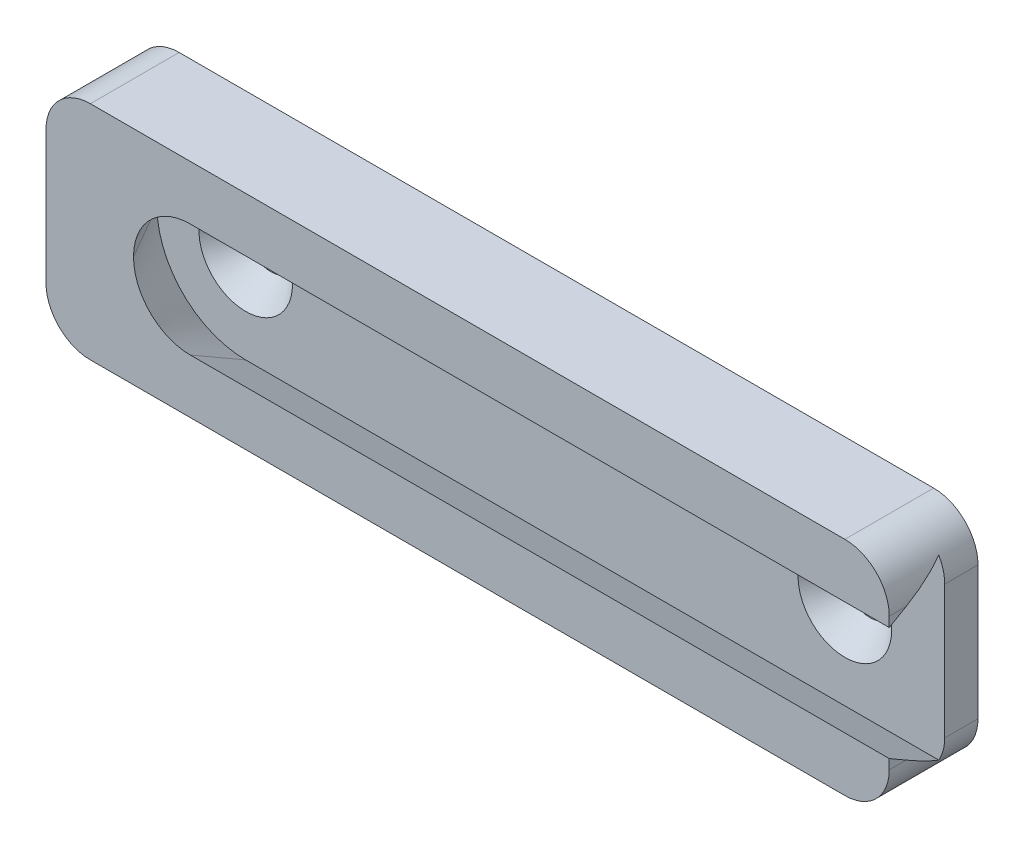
ISO-10303-21;
HEADER;
FILE_DESCRIPTION(('STEP AP214'),'2;1');
FILE_NAME('part.step','',(''),(''),'','','');
FILE_SCHEMA(('AUTOMOTIVE_DESIGN { 1 0 10303 214 1 1 1 1 }'));
ENDSEC;
DATA;
#1=APPLICATION_CONTEXT('core data for automotive mechanical design processes');
#2=APPLICATION_PROTOCOL_DEFINITION('international standard','automotive_design',2000,#1);
#3=PRODUCT_CONTEXT('',#1,'mechanical');
#4=PRODUCT('Part','Part','',(#3));
#5=PRODUCT_RELATED_PRODUCT_CATEGORY('part','',(#4));
#6=PRODUCT_DEFINITION_FORMATION('','',#4);
#7=PRODUCT_DEFINITION_CONTEXT('part definition',#1,'design');
#8=PRODUCT_DEFINITION('design','',#6,#7);
#9=PRODUCT_DEFINITION_SHAPE('','',#8);
#10=(LENGTH_UNIT() NAMED_UNIT(*) SI_UNIT(.MILLI.,.METRE.));
#11=(NAMED_UNIT(*) PLANE_ANGLE_UNIT() SI_UNIT($,.RADIAN.));
#12=(NAMED_UNIT(*) SI_UNIT($,.STERADIAN.) SOLID_ANGLE_UNIT());
#13=UNCERTAINTY_MEASURE_WITH_UNIT(LENGTH_MEASURE(1.E-05),#10,'distance_accuracy_value','');
#14=(GEOMETRIC_REPRESENTATION_CONTEXT(3) GLOBAL_UNCERTAINTY_ASSIGNED_CONTEXT((#13)) GLOBAL_UNIT_ASSIGNED_CONTEXT((#10,
#11,#12)) REPRESENTATION_CONTEXT('',''));
#15=CARTESIAN_POINT('',(0.,0.,0.));
#16=DIRECTION('',(0.,0.,1.));
#17=DIRECTION('',(1.,0.,0.));
#18=AXIS2_PLACEMENT_3D('',#15,#16,#17);
#19=CARTESIAN_POINT('',(-1.11022302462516E-13,9.99999999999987,4.99999999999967));
#20=DIRECTION('',(-1.,0.,0.));
#21=DIRECTION('',(0.,-1.,0.));
#22=AXIS2_PLACEMENT_3D('',#19,#20,#21);
#23=PLANE('',#22);
#24=DIRECTION('',(0.,1.,0.));
#25=VECTOR('',#24,1.);
#26=CARTESIAN_POINT('',(-1.11022302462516E-13,9.99999999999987,4.99999999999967));
#27=LINE('',#26,#25);
#28=CARTESIAN_POINT('',(0.,-6.00000000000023,4.99999999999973));
#29=VERTEX_POINT('',#28);
#30=CARTESIAN_POINT('',(0.,-5.11324865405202,4.99999999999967));
#31=VERTEX_POINT('',#30);
#32=EDGE_CURVE('E203',#29,#31,#27,.T.);
#33=ORIENTED_EDGE('',*,*,#32,.F.);
#34=DIRECTION('',(0.,0.,-1.00000000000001));
#35=VECTOR('',#34,1.);
#36=CARTESIAN_POINT('',(0.,-6.00000000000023,4.99999999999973));
#37=LINE('',#36,#35);
#38=CARTESIAN_POINT('',(0.,-6.00000000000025,3.46410161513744));
#39=VERTEX_POINT('',#38);
#40=EDGE_CURVE('E355',#29,#39,#37,.T.);
#41=ORIENTED_EDGE('',*,*,#40,.T.);
#42=DIRECTION('',(0.,-0.499999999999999,-0.866025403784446));
#43=VECTOR('',#42,1.);
#44=CARTESIAN_POINT('',(0.,-3.00000000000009,8.66025403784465));
#45=LINE('',#44,#43);
#46=EDGE_CURVE('E183',#39,#31,#45,.F.);
#47=ORIENTED_EDGE('',*,*,#46,.T.);
#48=EDGE_LOOP('',(#33,#41,#47));
#49=FACE_BOUND('',#48,.T.);
#50=ADVANCED_FACE('F37',(#49),#23,.F.);
#51=DIRECTION('',(0.,1.,0.));
#52=VECTOR('',#51,1.);
#53=CARTESIAN_POINT('',(0.,-10.0000000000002,-4.9960036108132E-13));
#54=LINE('',#53,#52);
#55=CARTESIAN_POINT('',(1.11022302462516E-13,-6.00000000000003,-3.88578058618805E-13));
#56=VERTEX_POINT('',#55);
#57=CARTESIAN_POINT('',(0.,5.99999999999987,-4.44089209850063E-13));
#58=VERTEX_POINT('',#57);
#59=EDGE_CURVE('E186',#56,#58,#54,.T.);
#60=ORIENTED_EDGE('',*,*,#59,.F.);
#61=DIRECTION('',(0.,0.,-1.00000000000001));
#62=VECTOR('',#61,1.);
#63=CARTESIAN_POINT('',(0.,-6.00000000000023,4.99999999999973));
#64=LINE('',#63,#62);
#65=CARTESIAN_POINT('',(0.,-6.00000000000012,-3.00000000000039));
#66=VERTEX_POINT('',#65);
#67=EDGE_CURVE('E358',#56,#66,#64,.T.);
#68=ORIENTED_EDGE('',*,*,#67,.T.);
#69=DIRECTION('',(0.,1.,0.));
#70=VECTOR('',#69,1.);
#71=CARTESIAN_POINT('',(1.52655665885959E-13,-10.0000000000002,-3.00000000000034));
#72=LINE('',#71,#70);
#73=CARTESIAN_POINT('',(-1.11022302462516E-13,5.99999999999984,-3.00000000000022));
#74=VERTEX_POINT('',#73);
#75=EDGE_CURVE('E190',#66,#74,#72,.T.);
#76=ORIENTED_EDGE('',*,*,#75,.T.);
#77=DIRECTION('',(0.,0.,-1.00000000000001));
#78=VECTOR('',#77,1.);
#79=CARTESIAN_POINT('',(-1.66533453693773E-13,5.99999999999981,4.99999999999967));
#80=LINE('',#79,#78);
#81=EDGE_CURVE('E321',#74,#58,#80,.F.);
#82=ORIENTED_EDGE('',*,*,#81,.T.);
#83=EDGE_LOOP('',(#60,#68,#76,#82));
#84=FACE_BOUND('',#83,.T.);
#85=ADVANCED_FACE('F298',(#84),#23,.F.);
#86=CARTESIAN_POINT('',(-76.0000000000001,9.9999999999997,4.99999999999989));
#87=DIRECTION('',(1.,0.,0.));
#88=DIRECTION('',(0.,0.,-1.00000000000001));
#89=AXIS2_PLACEMENT_3D('',#86,#87,#88);
#90=PLANE('',#89);
#91=DIRECTION('',(0.,-1.,0.));
#92=VECTOR('',#91,1.);
#93=CARTESIAN_POINT('',(-76.,-10.0000000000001,-3.00000000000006));
#94=LINE('',#93,#92);
#95=CARTESIAN_POINT('',(-76.,5.99999999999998,-2.99999999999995));
#96=VERTEX_POINT('',#95);
#97=CARTESIAN_POINT('',(-76.,-6.00000000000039,-2.99999999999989));
#98=VERTEX_POINT('',#97);
#99=EDGE_CURVE('E240',#96,#98,#94,.T.);
#100=ORIENTED_EDGE('',*,*,#99,.T.);
#101=DIRECTION('',(0.,0.,-1.00000000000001));
#102=VECTOR('',#101,1.);
#103=CARTESIAN_POINT('',(-76.0000000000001,-6.00000000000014,5.));
#104=LINE('',#103,#102);
#105=CARTESIAN_POINT('',(-76.0000000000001,-6.00000000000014,5.));
#106=VERTEX_POINT('',#105);
#107=EDGE_CURVE('E11',#98,#106,#104,.F.);
#108=ORIENTED_EDGE('',*,*,#107,.T.);
#109=DIRECTION('',(0.,-1.,0.));
#110=VECTOR('',#109,1.);
#111=CARTESIAN_POINT('',(-76.0000000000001,9.9999999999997,4.99999999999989));
#112=LINE('',#111,#110);
#113=CARTESIAN_POINT('',(-76.0000000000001,5.99999999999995,5.00000000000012));
#114=VERTEX_POINT('',#113);
#115=EDGE_CURVE('E198',#114,#106,#112,.T.);
#116=ORIENTED_EDGE('',*,*,#115,.F.);
#117=DIRECTION('',(0.,0.,-1.00000000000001));
#118=VECTOR('',#117,1.);
#119=CARTESIAN_POINT('',(-76.0000000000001,5.99999999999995,5.00000000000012));
#120=LINE('',#119,#118);
#121=EDGE_CURVE('E45',#114,#96,#120,.T.);
#122=ORIENTED_EDGE('',*,*,#121,.T.);
#123=EDGE_LOOP('',(#100,#108,#116,#122));
#124=FACE_BOUND('',#123,.T.);
#125=ADVANCED_FACE('F239',(#124),#90,.F.);
#126=CARTESIAN_POINT('',(-76.0000000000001,-10.0000000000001,5.));
#127=DIRECTION('',(0.,1.,0.));
#128=DIRECTION('',(-1.,0.,0.));
#129=AXIS2_PLACEMENT_3D('',#126,#127,#128);
#130=PLANE('',#129);
#131=DIRECTION('',(1.,0.,0.));
#132=VECTOR('',#131,1.);
#133=CARTESIAN_POINT('',(1.52655665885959E-13,-10.0000000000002,-3.00000000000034));
#134=LINE('',#133,#132);
#135=CARTESIAN_POINT('',(-72.,-10.0000000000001,-2.99999999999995));
#136=VERTEX_POINT('',#135);
#137=CARTESIAN_POINT('',(-3.99999999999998,-10.0000000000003,-3.00000000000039));
#138=VERTEX_POINT('',#137);
#139=EDGE_CURVE('E196',#136,#138,#134,.T.);
#140=ORIENTED_EDGE('',*,*,#139,.T.);
#141=DIRECTION('',(0.,0.,-1.00000000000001));
#142=VECTOR('',#141,1.);
#143=CARTESIAN_POINT('',(-3.99999999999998,-10.0000000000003,4.99999999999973));
#144=LINE('',#143,#142);
#145=CARTESIAN_POINT('',(-3.99999999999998,-10.0000000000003,4.99999999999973));
#146=VERTEX_POINT('',#145);
#147=EDGE_CURVE('E345',#138,#146,#144,.F.);
#148=ORIENTED_EDGE('',*,*,#147,.T.);
#149=DIRECTION('',(1.,0.,0.));
#150=VECTOR('',#149,1.);
#151=CARTESIAN_POINT('',(-76.0000000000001,-10.0000000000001,5.));
#152=LINE('',#151,#150);
#153=CARTESIAN_POINT('',(-72.0000000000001,-10.,4.99999999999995));
#154=VERTEX_POINT('',#153);
#155=EDGE_CURVE('E200',#154,#146,#152,.T.);
#156=ORIENTED_EDGE('',*,*,#155,.F.);
#157=DIRECTION('',(0.,0.,-1.00000000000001));
#158=VECTOR('',#157,1.);
#159=CARTESIAN_POINT('',(-72.0000000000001,-10.,4.99999999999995));
#160=LINE('',#159,#158);
#161=EDGE_CURVE('E342',#154,#136,#160,.T.);
#162=ORIENTED_EDGE('',*,*,#161,.T.);
#163=EDGE_LOOP('',(#140,#148,#156,#162));
#164=FACE_BOUND('',#163,.T.);
#165=ADVANCED_FACE('F310',(#164),#130,.F.);
#166=DIRECTION('',(0.,-0.499999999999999,0.866025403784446));
#167=VECTOR('',#166,1.);
#168=CARTESIAN_POINT('',(0.,2.99999999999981,8.66025403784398));
#169=LINE('',#168,#167);
#170=CARTESIAN_POINT('',(-1.38777878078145E-13,5.11324865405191,4.99999999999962));
#171=VERTEX_POINT('',#170);
#172=CARTESIAN_POINT('',(0.,5.99999999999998,3.46410161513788));
#173=VERTEX_POINT('',#172);
#174=EDGE_CURVE('E317',#171,#173,#169,.F.);
#175=ORIENTED_EDGE('',*,*,#174,.T.);
#176=DIRECTION('',(0.,0.,-1.00000000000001));
#177=VECTOR('',#176,1.);
#178=CARTESIAN_POINT('',(-1.66533453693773E-13,5.99999999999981,4.99999999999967));
#179=LINE('',#178,#177);
#180=CARTESIAN_POINT('',(-1.66533453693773E-13,5.99999999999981,4.99999999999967));
#181=VERTEX_POINT('',#180);
#182=EDGE_CURVE('E222',#173,#181,#179,.F.);
#183=ORIENTED_EDGE('',*,*,#182,.T.);
#184=EDGE_CURVE('E202',#171,#181,#27,.T.);
#185=ORIENTED_EDGE('',*,*,#184,.F.);
#186=EDGE_LOOP('',(#175,#183,#185));
#187=FACE_BOUND('',#186,.T.);
#188=ADVANCED_FACE('F301',(#187),#23,.F.);
#189=CARTESIAN_POINT('',(-76.0000000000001,9.9999999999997,4.99999999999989));
#190=DIRECTION('',(0.,-1.,0.));
#191=DIRECTION('',(1.,0.,0.));
#192=AXIS2_PLACEMENT_3D('',#189,#190,#191);
#193=PLANE('',#192);
#194=DIRECTION('',(-1.,0.,0.));
#195=VECTOR('',#194,1.);
#196=CARTESIAN_POINT('',(-76.0000000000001,9.9999999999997,4.99999999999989));
#197=LINE('',#196,#195);
#198=CARTESIAN_POINT('',(-4.00000000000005,9.99999999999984,4.99999999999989));
#199=VERTEX_POINT('',#198);
#200=CARTESIAN_POINT('',(-72.,10.,4.99999999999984));
#201=VERTEX_POINT('',#200);
#202=EDGE_CURVE('E171',#199,#201,#197,.T.);
#203=ORIENTED_EDGE('',*,*,#202,.F.);
#204=DIRECTION('',(0.,0.,-1.00000000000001));
#205=VECTOR('',#204,1.);
#206=CARTESIAN_POINT('',(-4.00000000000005,9.99999999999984,4.99999999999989));
#207=LINE('',#206,#205);
#208=CARTESIAN_POINT('',(-4.00000000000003,9.99999999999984,-3.00000000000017));
#209=VERTEX_POINT('',#208);
#210=EDGE_CURVE('E224',#199,#209,#207,.T.);
#211=ORIENTED_EDGE('',*,*,#210,.T.);
#212=DIRECTION('',(-1.,0.,0.));
#213=VECTOR('',#212,1.);
#214=CARTESIAN_POINT('',(0.,9.9999999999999,-3.00000000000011));
#215=LINE('',#214,#213);
#216=CARTESIAN_POINT('',(-72.0000000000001,9.99999999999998,-3.00000000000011));
#217=VERTEX_POINT('',#216);
#218=EDGE_CURVE('E250',#209,#217,#215,.T.);
#219=ORIENTED_EDGE('',*,*,#218,.T.);
#220=DIRECTION('',(0.,0.,-1.00000000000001));
#221=VECTOR('',#220,1.);
#222=CARTESIAN_POINT('',(-72.,10.,4.99999999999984));
#223=LINE('',#222,#221);
#224=EDGE_CURVE('E228',#217,#201,#223,.F.);
#225=ORIENTED_EDGE('',*,*,#224,.T.);
#226=EDGE_LOOP('',(#203,#211,#219,#225));
#227=FACE_BOUND('',#226,.T.);
#228=ADVANCED_FACE('F309',(#227),#193,.F.);
#229=CARTESIAN_POINT('',(0.,-1.11022302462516E-13,4.99999999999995));
#230=DIRECTION('',(0.,0.,1.00000000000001));
#231=DIRECTION('',(1.,0.,0.));
#232=AXIS2_PLACEMENT_3D('',#229,#230,#231);
#233=PLANE('',#232);
#234=ORIENTED_EDGE('',*,*,#155,.T.);
#235=CARTESIAN_POINT('',(-3.99999999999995,-6.00000000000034,4.99999999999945));
#236=DIRECTION('',(0.,0.,1.00000000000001));
#237=DIRECTION('',(1.,0.,0.));
#238=AXIS2_PLACEMENT_3D('',#235,#236,#237);
#239=CIRCLE('',#238,4.);
#240=EDGE_CURVE('E225',#146,#29,#239,.T.);
#241=ORIENTED_EDGE('',*,*,#240,.T.);
#242=ORIENTED_EDGE('',*,*,#32,.T.);
#243=DIRECTION('',(1.,0.,0.));
#244=VECTOR('',#243,1.);
#245=CARTESIAN_POINT('',(0.,-5.11324865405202,4.99999999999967));
#246=LINE('',#245,#244);
#247=CARTESIAN_POINT('',(-63.0000000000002,-5.11324865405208,4.99999999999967));
#248=VERTEX_POINT('',#247);
#249=EDGE_CURVE('E319',#31,#248,#246,.F.);
#250=ORIENTED_EDGE('',*,*,#249,.T.);
#251=CARTESIAN_POINT('',(-63.0000000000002,-2.77555756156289E-13,4.99999999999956));
#252=DIRECTION('',(0.,0.,1.00000000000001));
#253=DIRECTION('',(1.,0.,0.));
#254=AXIS2_PLACEMENT_3D('',#251,#252,#253);
#255=CIRCLE('',#254,5.11324865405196);
#256=CARTESIAN_POINT('',(-68.1132486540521,-1.66533453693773E-13,4.99999999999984));
#257=VERTEX_POINT('',#256);
#258=EDGE_CURVE('E322',#248,#257,#255,.F.);
#259=ORIENTED_EDGE('',*,*,#258,.T.);
#260=CARTESIAN_POINT('',(-63.0000000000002,-2.77555756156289E-13,4.99999999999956));
#261=DIRECTION('',(0.,0.,1.00000000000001));
#262=DIRECTION('',(1.,0.,0.));
#263=AXIS2_PLACEMENT_3D('',#260,#261,#262);
#264=CIRCLE('',#263,5.11324865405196);
#265=CARTESIAN_POINT('',(-63.0000000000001,5.11324865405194,5.00000000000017));
#266=VERTEX_POINT('',#265);
#267=EDGE_CURVE('E163',#257,#266,#264,.F.);
#268=ORIENTED_EDGE('',*,*,#267,.T.);
#269=DIRECTION('',(-1.,0.,0.));
#270=VECTOR('',#269,1.);
#271=CARTESIAN_POINT('',(-1.38777878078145E-13,5.11324865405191,4.99999999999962));
#272=LINE('',#271,#270);
#273=EDGE_CURVE('E178',#266,#171,#272,.F.);
#274=ORIENTED_EDGE('',*,*,#273,.T.);
#275=ORIENTED_EDGE('',*,*,#184,.T.);
#276=CARTESIAN_POINT('',(-4.00000000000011,5.99999999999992,4.99999999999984));
#277=DIRECTION('',(0.,0.,1.00000000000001));
#278=DIRECTION('',(1.,0.,0.));
#279=AXIS2_PLACEMENT_3D('',#276,#277,#278);
#280=CIRCLE('',#279,4.);
#281=EDGE_CURVE('E210',#181,#199,#280,.T.);
#282=ORIENTED_EDGE('',*,*,#281,.T.);
#283=ORIENTED_EDGE('',*,*,#202,.T.);
#284=CARTESIAN_POINT('',(-72.,5.99999999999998,5.00000000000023));
#285=DIRECTION('',(0.,0.,1.00000000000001));
#286=DIRECTION('',(1.,0.,0.));
#287=AXIS2_PLACEMENT_3D('',#284,#285,#286);
#288=CIRCLE('',#287,4.);
#289=EDGE_CURVE('E57',#201,#114,#288,.T.);
#290=ORIENTED_EDGE('',*,*,#289,.T.);
#291=ORIENTED_EDGE('',*,*,#115,.T.);
#292=CARTESIAN_POINT('',(-72.0000000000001,-6.00000000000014,4.99999999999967));
#293=DIRECTION('',(0.,0.,1.00000000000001));
#294=DIRECTION('',(1.,0.,0.));
#295=AXIS2_PLACEMENT_3D('',#292,#293,#294);
#296=CIRCLE('',#295,4.);
#297=EDGE_CURVE('E226',#106,#154,#296,.T.);
#298=ORIENTED_EDGE('',*,*,#297,.T.);
#299=EDGE_LOOP('',(#234,#241,#242,#250,#259,#268,#274,#275,#282,#283,#290,#291,#298));
#300=FACE_BOUND('',#299,.T.);
#301=ADVANCED_FACE('F209',(#300),#233,.T.);
#302=CARTESIAN_POINT('',(0.,2.99999999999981,8.66025403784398));
#303=DIRECTION('',(0.,0.866025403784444,0.499999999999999));
#304=DIRECTION('',(1.,0.,0.));
#305=AXIS2_PLACEMENT_3D('',#302,#303,#304);
#306=PLANE('',#305);
#307=DIRECTION('',(-1.,0.,0.));
#308=VECTOR('',#307,1.);
#309=CARTESIAN_POINT('',(0.,8.00000000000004,-3.33066907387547E-13));
#310=LINE('',#309,#308);
#311=CARTESIAN_POINT('',(-0.535898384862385,7.99999999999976,-3.33066907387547E-13));
#312=VERTEX_POINT('',#311);
#313=CARTESIAN_POINT('',(-63.0000000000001,7.99999999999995,-1.11022302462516E-13));
#314=VERTEX_POINT('',#313);
#315=EDGE_CURVE('E168',#312,#314,#310,.T.);
#316=ORIENTED_EDGE('',*,*,#315,.F.);
#317=CARTESIAN_POINT('',(-4.00000000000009,5.99999999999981,3.46410161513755));
#318=DIRECTION('',(0.,0.866025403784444,0.499999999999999));
#319=DIRECTION('',(0.,0.499999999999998,-0.866025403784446));
#320=AXIS2_PLACEMENT_3D('',#317,#318,#319);
#321=ELLIPSE('',#320,8.00000000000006,4.);
#322=EDGE_CURVE('E235',#312,#173,#321,.F.);
#323=ORIENTED_EDGE('',*,*,#322,.T.);
#324=ORIENTED_EDGE('',*,*,#174,.F.);
#325=ORIENTED_EDGE('',*,*,#273,.F.);
#326=DIRECTION('',(0.,-0.499999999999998,0.866025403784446));
#327=VECTOR('',#326,1.);
#328=CARTESIAN_POINT('',(-63.0000000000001,7.99999999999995,-1.11022302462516E-13));
#329=LINE('',#328,#327);
#330=EDGE_CURVE('E164',#314,#266,#329,.T.);
#331=ORIENTED_EDGE('',*,*,#330,.F.);
#332=EDGE_LOOP('',(#316,#323,#324,#325,#331));
#333=FACE_BOUND('',#332,.T.);
#334=ADVANCED_FACE('F364',(#333),#306,.F.);
#335=CARTESIAN_POINT('',(-63.0000000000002,-3.33066907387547E-13,-1.66533453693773E-13));
#336=DIRECTION('',(0.,0.,-1.00000000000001));
#337=DIRECTION('',(-1.,0.,0.));
#338=AXIS2_PLACEMENT_3D('',#335,#336,#337);
#339=CONICAL_SURFACE('',#338,8.00000000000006,0.523598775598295);
#340=ORIENTED_EDGE('',*,*,#330,.T.);
#341=ORIENTED_EDGE('',*,*,#267,.F.);
#342=DIRECTION('',(0.499999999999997,0.,0.866025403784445));
#343=VECTOR('',#342,1.);
#344=CARTESIAN_POINT('',(-71.0000000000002,0.,-1.66533453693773E-13));
#345=LINE('',#344,#343);
#346=CARTESIAN_POINT('',(-71.0000000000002,0.,-1.66533453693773E-13));
#347=VERTEX_POINT('',#346);
#348=EDGE_CURVE('E149',#347,#257,#345,.T.);
#349=ORIENTED_EDGE('',*,*,#348,.F.);
#350=CARTESIAN_POINT('',(-63.0000000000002,-3.33066907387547E-13,-1.66533453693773E-13));
#351=DIRECTION('',(0.,0.,1.00000000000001));
#352=DIRECTION('',(1.,0.,0.));
#353=AXIS2_PLACEMENT_3D('',#350,#351,#352);
#354=CIRCLE('',#353,8.00000000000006);
#355=EDGE_CURVE('E156',#314,#347,#354,.T.);
#356=ORIENTED_EDGE('',*,*,#355,.F.);
#357=EDGE_LOOP('',(#340,#341,#349,#356));
#358=FACE_BOUND('',#357,.T.);
#359=ADVANCED_FACE('F162',(#358),#339,.F.);
#360=CARTESIAN_POINT('',(-63.0000000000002,-3.33066907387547E-13,-1.66533453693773E-13));
#361=DIRECTION('',(0.,0.,-1.00000000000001));
#362=DIRECTION('',(-1.,0.,0.));
#363=AXIS2_PLACEMENT_3D('',#360,#361,#362);
#364=CONICAL_SURFACE('',#363,8.00000000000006,0.523598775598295);
#365=ORIENTED_EDGE('',*,*,#348,.T.);
#366=ORIENTED_EDGE('',*,*,#258,.F.);
#367=DIRECTION('',(0.,0.499999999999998,0.866025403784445));
#368=VECTOR('',#367,1.);
#369=CARTESIAN_POINT('',(-63.0000000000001,-8.00000000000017,-3.88578058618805E-13));
#370=LINE('',#369,#368);
#371=CARTESIAN_POINT('',(-63.0000000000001,-8.00000000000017,-3.88578058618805E-13));
#372=VERTEX_POINT('',#371);
#373=EDGE_CURVE('E151',#372,#248,#370,.T.);
#374=ORIENTED_EDGE('',*,*,#373,.F.);
#375=CARTESIAN_POINT('',(-63.0000000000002,-3.33066907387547E-13,-1.66533453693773E-13));
#376=DIRECTION('',(0.,0.,1.00000000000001));
#377=DIRECTION('',(1.,0.,0.));
#378=AXIS2_PLACEMENT_3D('',#375,#376,#377);
#379=CIRCLE('',#378,8.00000000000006);
#380=EDGE_CURVE('E145',#347,#372,#379,.T.);
#381=ORIENTED_EDGE('',*,*,#380,.F.);
#382=EDGE_LOOP('',(#365,#366,#374,#381));
#383=FACE_BOUND('',#382,.T.);
#384=ADVANCED_FACE('F147',(#383),#364,.F.);
#385=CARTESIAN_POINT('',(0.,-3.00000000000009,8.66025403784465));
#386=DIRECTION('',(0.,-0.866025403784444,0.499999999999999));
#387=DIRECTION('',(-1.,0.,0.));
#388=AXIS2_PLACEMENT_3D('',#385,#386,#387);
#389=PLANE('',#388);
#390=ORIENTED_EDGE('',*,*,#46,.F.);
#391=CARTESIAN_POINT('',(-3.99999999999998,-6.00000000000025,3.46410161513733));
#392=DIRECTION('',(0.,-0.866025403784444,0.499999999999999));
#393=DIRECTION('',(0.,-0.499999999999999,-0.866025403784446));
#394=AXIS2_PLACEMENT_3D('',#391,#392,#393);
#395=ELLIPSE('',#394,8.00000000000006,4.);
#396=CARTESIAN_POINT('',(-0.535898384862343,-8.0000000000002,-1.66533453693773E-13));
#397=VERTEX_POINT('',#396);
#398=EDGE_CURVE('E330',#39,#397,#395,.F.);
#399=ORIENTED_EDGE('',*,*,#398,.T.);
#400=DIRECTION('',(1.,0.,0.));
#401=VECTOR('',#400,1.);
#402=CARTESIAN_POINT('',(0.,-8.00000000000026,-3.88578058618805E-13));
#403=LINE('',#402,#401);
#404=EDGE_CURVE('E155',#372,#397,#403,.T.);
#405=ORIENTED_EDGE('',*,*,#404,.F.);
#406=ORIENTED_EDGE('',*,*,#373,.T.);
#407=ORIENTED_EDGE('',*,*,#249,.F.);
#408=EDGE_LOOP('',(#390,#399,#405,#406,#407));
#409=FACE_BOUND('',#408,.T.);
#410=ADVANCED_FACE('F367',(#409),#389,.F.);
#411=CARTESIAN_POINT('',(0.,-1.66533453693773E-13,-3.00000000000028));
#412=DIRECTION('',(0.,0.,1.00000000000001));
#413=DIRECTION('',(1.,0.,0.));
#414=AXIS2_PLACEMENT_3D('',#411,#412,#413);
#415=PLANE('',#414);
#416=CARTESIAN_POINT('',(-63.0000000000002,0.,-3.00000000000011));
#417=DIRECTION('',(0.,0.,1.00000000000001));
#418=DIRECTION('',(1.,0.,0.));
#419=AXIS2_PLACEMENT_3D('',#416,#417,#418);
#420=CIRCLE('',#419,2.2479);
#421=CARTESIAN_POINT('',(-60.7521000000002,0.,-3.00000000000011));
#422=VERTEX_POINT('',#421);
#423=EDGE_CURVE('E264',#422,#422,#420,.T.);
#424=ORIENTED_EDGE('',*,*,#423,.T.);
#425=EDGE_LOOP('',(#424));
#426=FACE_BOUND('',#425,.T.);
#427=CARTESIAN_POINT('',(-9.00000000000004,-1.66533453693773E-13,-3.00000000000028));
#428=DIRECTION('',(0.,0.,1.00000000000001));
#429=DIRECTION('',(1.,0.,0.));
#430=AXIS2_PLACEMENT_3D('',#427,#428,#429);
#431=CIRCLE('',#430,2.2479);
#432=CARTESIAN_POINT('',(-6.75210000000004,-1.66658237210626E-13,-3.00000000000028));
#433=VERTEX_POINT('',#432);
#434=EDGE_CURVE('E191',#433,#433,#431,.T.);
#435=ORIENTED_EDGE('',*,*,#434,.T.);
#436=EDGE_LOOP('',(#435));
#437=FACE_BOUND('',#436,.T.);
#438=ORIENTED_EDGE('',*,*,#75,.F.);
#439=CARTESIAN_POINT('',(-3.99999999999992,-6.00000000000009,-3.00000000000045));
#440=DIRECTION('',(0.,0.,1.00000000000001));
#441=DIRECTION('',(1.,0.,0.));
#442=AXIS2_PLACEMENT_3D('',#439,#440,#441);
#443=CIRCLE('',#442,4.);
#444=EDGE_CURVE('E340',#66,#138,#443,.F.);
#445=ORIENTED_EDGE('',*,*,#444,.T.);
#446=ORIENTED_EDGE('',*,*,#139,.F.);
#447=CARTESIAN_POINT('',(-71.9999999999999,-6.00000000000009,-3.00000000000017));
#448=DIRECTION('',(0.,0.,1.00000000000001));
#449=DIRECTION('',(1.,0.,0.));
#450=AXIS2_PLACEMENT_3D('',#447,#448,#449);
#451=CIRCLE('',#450,4.);
#452=EDGE_CURVE('E249',#136,#98,#451,.F.);
#453=ORIENTED_EDGE('',*,*,#452,.T.);
#454=ORIENTED_EDGE('',*,*,#99,.F.);
#455=CARTESIAN_POINT('',(-72.,5.99999999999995,-3.00000000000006));
#456=DIRECTION('',(0.,0.,1.00000000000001));
#457=DIRECTION('',(1.,0.,0.));
#458=AXIS2_PLACEMENT_3D('',#455,#456,#457);
#459=CIRCLE('',#458,4.);
#460=EDGE_CURVE('E246',#96,#217,#459,.F.);
#461=ORIENTED_EDGE('',*,*,#460,.T.);
#462=ORIENTED_EDGE('',*,*,#218,.F.);
#463=CARTESIAN_POINT('',(-4.00000000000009,5.99999999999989,-3.00000000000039));
#464=DIRECTION('',(0.,0.,1.00000000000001));
#465=DIRECTION('',(1.,0.,0.));
#466=AXIS2_PLACEMENT_3D('',#463,#464,#465);
#467=CIRCLE('',#466,4.);
#468=EDGE_CURVE('E338',#209,#74,#467,.F.);
#469=ORIENTED_EDGE('',*,*,#468,.T.);
#470=EDGE_LOOP('',(#438,#445,#446,#453,#454,#461,#462,#469));
#471=FACE_BOUND('',#470,.T.);
#472=ADVANCED_FACE('F244',(#426,#437,#471),#415,.F.);
#473=CARTESIAN_POINT('',(0.,0.,0.));
#474=DIRECTION('',(0.,0.,1.00000000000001));
#475=DIRECTION('',(1.,0.,0.));
#476=AXIS2_PLACEMENT_3D('',#473,#474,#475);
#477=PLANE('',#476);
#478=CARTESIAN_POINT('',(-63.0000000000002,-3.33066907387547E-13,-1.66533453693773E-13));
#479=DIRECTION('',(0.,0.,1.00000000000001));
#480=DIRECTION('',(1.,0.,0.));
#481=AXIS2_PLACEMENT_3D('',#478,#479,#480);
#482=CIRCLE('',#481,4.2164);
#483=CARTESIAN_POINT('',(-58.7836000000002,-3.33300964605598E-13,-1.68171854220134E-13));
#484=VERTEX_POINT('',#483);
#485=EDGE_CURVE('E270',#484,#484,#482,.T.);
#486=ORIENTED_EDGE('',*,*,#485,.F.);
#487=EDGE_LOOP('',(#486));
#488=FACE_BOUND('',#487,.T.);
#489=CARTESIAN_POINT('',(-8.99999999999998,-2.77555756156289E-13,0.));
#490=DIRECTION('',(0.,0.,1.00000000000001));
#491=DIRECTION('',(1.,0.,0.));
#492=AXIS2_PLACEMENT_3D('',#489,#490,#491);
#493=CIRCLE('',#492,4.2164);
#494=CARTESIAN_POINT('',(-4.78359999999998,-2.77789813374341E-13,0.));
#495=VERTEX_POINT('',#494);
#496=EDGE_CURVE('E261',#495,#495,#493,.T.);
#497=ORIENTED_EDGE('',*,*,#496,.F.);
#498=EDGE_LOOP('',(#497));
#499=FACE_BOUND('',#498,.T.);
#500=ORIENTED_EDGE('',*,*,#404,.T.);
#501=CARTESIAN_POINT('',(-3.99999999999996,-6.0000000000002,-3.33066907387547E-13));
#502=DIRECTION('',(0.,0.,1.00000000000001));
#503=DIRECTION('',(1.,0.,0.));
#504=AXIS2_PLACEMENT_3D('',#501,#502,#503);
#505=CIRCLE('',#504,4.);
#506=EDGE_CURVE('E334',#397,#56,#505,.T.);
#507=ORIENTED_EDGE('',*,*,#506,.T.);
#508=ORIENTED_EDGE('',*,*,#59,.T.);
#509=CARTESIAN_POINT('',(-4.,5.99999999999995,-4.9960036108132E-13));
#510=DIRECTION('',(0.,0.,1.00000000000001));
#511=DIRECTION('',(1.,0.,0.));
#512=AXIS2_PLACEMENT_3D('',#509,#510,#511);
#513=CIRCLE('',#512,4.);
#514=EDGE_CURVE('E332',#58,#312,#513,.T.);
#515=ORIENTED_EDGE('',*,*,#514,.T.);
#516=ORIENTED_EDGE('',*,*,#315,.T.);
#517=ORIENTED_EDGE('',*,*,#355,.T.);
#518=ORIENTED_EDGE('',*,*,#380,.T.);
#519=EDGE_LOOP('',(#500,#507,#508,#515,#516,#517,#518));
#520=FACE_BOUND('',#519,.T.);
#521=ADVANCED_FACE('F166',(#488,#499,#520),#477,.T.);
#522=CARTESIAN_POINT('',(-3.99999999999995,-6.00000000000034,4.99999999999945));
#523=DIRECTION('',(0.,0.,-1.00000000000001));
#524=DIRECTION('',(-1.,0.,0.));
#525=AXIS2_PLACEMENT_3D('',#522,#523,#524);
#526=CYLINDRICAL_SURFACE('',#525,4.);
#527=ORIENTED_EDGE('',*,*,#240,.F.);
#528=ORIENTED_EDGE('',*,*,#147,.F.);
#529=ORIENTED_EDGE('',*,*,#444,.F.);
#530=ORIENTED_EDGE('',*,*,#67,.F.);
#531=ORIENTED_EDGE('',*,*,#506,.F.);
#532=ORIENTED_EDGE('',*,*,#398,.F.);
#533=ORIENTED_EDGE('',*,*,#40,.F.);
#534=EDGE_LOOP('',(#527,#528,#529,#530,#531,#532,#533));
#535=FACE_BOUND('',#534,.T.);
#536=ADVANCED_FACE('F278',(#535),#526,.T.);
#537=CARTESIAN_POINT('',(-4.00000000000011,5.99999999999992,4.99999999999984));
#538=DIRECTION('',(0.,0.,-1.00000000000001));
#539=DIRECTION('',(-1.,0.,0.));
#540=AXIS2_PLACEMENT_3D('',#537,#538,#539);
#541=CYLINDRICAL_SURFACE('',#540,4.);
#542=ORIENTED_EDGE('',*,*,#514,.F.);
#543=ORIENTED_EDGE('',*,*,#81,.F.);
#544=ORIENTED_EDGE('',*,*,#468,.F.);
#545=ORIENTED_EDGE('',*,*,#210,.F.);
#546=ORIENTED_EDGE('',*,*,#281,.F.);
#547=ORIENTED_EDGE('',*,*,#182,.F.);
#548=ORIENTED_EDGE('',*,*,#322,.F.);
#549=EDGE_LOOP('',(#542,#543,#544,#545,#546,#547,#548));
#550=FACE_BOUND('',#549,.T.);
#551=ADVANCED_FACE('F220',(#550),#541,.T.);
#552=CARTESIAN_POINT('',(-72.0000000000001,-6.00000000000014,4.99999999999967));
#553=DIRECTION('',(0.,0.,-1.00000000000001));
#554=DIRECTION('',(-1.,0.,0.));
#555=AXIS2_PLACEMENT_3D('',#552,#553,#554);
#556=CYLINDRICAL_SURFACE('',#555,4.);
#557=ORIENTED_EDGE('',*,*,#297,.F.);
#558=ORIENTED_EDGE('',*,*,#107,.F.);
#559=ORIENTED_EDGE('',*,*,#452,.F.);
#560=ORIENTED_EDGE('',*,*,#161,.F.);
#561=EDGE_LOOP('',(#557,#558,#559,#560));
#562=FACE_BOUND('',#561,.T.);
#563=ADVANCED_FACE('F372',(#562),#556,.T.);
#564=CARTESIAN_POINT('',(-72.,5.99999999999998,5.00000000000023));
#565=DIRECTION('',(0.,0.,-1.00000000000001));
#566=DIRECTION('',(-1.,0.,0.));
#567=AXIS2_PLACEMENT_3D('',#564,#565,#566);
#568=CYLINDRICAL_SURFACE('',#567,4.);
#569=ORIENTED_EDGE('',*,*,#289,.F.);
#570=ORIENTED_EDGE('',*,*,#224,.F.);
#571=ORIENTED_EDGE('',*,*,#460,.F.);
#572=ORIENTED_EDGE('',*,*,#121,.F.);
#573=EDGE_LOOP('',(#569,#570,#571,#572));
#574=FACE_BOUND('',#573,.T.);
#575=ADVANCED_FACE('F39',(#574),#568,.T.);
#576=CARTESIAN_POINT('',(-8.99999999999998,-2.77555756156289E-13,0.));
#577=DIRECTION('',(0.,0.,1.00000000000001));
#578=DIRECTION('',(1.,0.,0.));
#579=AXIS2_PLACEMENT_3D('',#576,#577,#578);
#580=CYLINDRICAL_SURFACE('',#579,2.2479);
#581=ORIENTED_EDGE('',*,*,#434,.F.);
#582=EDGE_LOOP('',(#581));
#583=FACE_BOUND('',#582,.T.);
#584=CARTESIAN_POINT('',(-9.00000000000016,-2.4980018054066E-13,-2.26450020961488));
#585=DIRECTION('',(0.,0.,1.00000000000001));
#586=DIRECTION('',(1.,0.,0.));
#587=AXIS2_PLACEMENT_3D('',#584,#585,#586);
#588=CIRCLE('',#587,2.2479);
#589=CARTESIAN_POINT('',(-6.75210000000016,-2.49924964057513E-13,-2.26450020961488));
#590=VERTEX_POINT('',#589);
#591=EDGE_CURVE('E258',#590,#590,#588,.T.);
#592=ORIENTED_EDGE('',*,*,#591,.T.);
#593=EDGE_LOOP('',(#592));
#594=FACE_BOUND('',#593,.T.);
#595=ADVANCED_FACE('F285',(#583,#594),#580,.F.);
#596=CARTESIAN_POINT('',(-8.99999999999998,-2.77555756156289E-13,0.));
#597=DIRECTION('',(0.,0.,1.00000000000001));
#598=DIRECTION('',(1.,0.,0.));
#599=AXIS2_PLACEMENT_3D('',#596,#597,#598);
#600=CONICAL_SURFACE('',#599,4.2164,0.715584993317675);
#601=ORIENTED_EDGE('',*,*,#591,.F.);
#602=EDGE_LOOP('',(#601));
#603=FACE_BOUND('',#602,.T.);
#604=ORIENTED_EDGE('',*,*,#496,.T.);
#605=EDGE_LOOP('',(#604));
#606=FACE_BOUND('',#605,.T.);
#607=ADVANCED_FACE('F282',(#603,#606),#600,.F.);
#608=CARTESIAN_POINT('',(-63.0000000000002,-3.33066907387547E-13,-1.66533453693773E-13));
#609=DIRECTION('',(0.,0.,1.00000000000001));
#610=DIRECTION('',(1.,0.,0.));
#611=AXIS2_PLACEMENT_3D('',#608,#609,#610);
#612=CYLINDRICAL_SURFACE('',#611,2.2479);
#613=ORIENTED_EDGE('',*,*,#423,.F.);
#614=EDGE_LOOP('',(#613));
#615=FACE_BOUND('',#614,.T.);
#616=CARTESIAN_POINT('',(-63.,0.,-2.26450020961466));
#617=DIRECTION('',(0.,0.,1.00000000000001));
#618=DIRECTION('',(1.,0.,0.));
#619=AXIS2_PLACEMENT_3D('',#616,#617,#618);
#620=CIRCLE('',#619,2.2479);
#621=CARTESIAN_POINT('',(-60.7521,0.,-2.26450020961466));
#622=VERTEX_POINT('',#621);
#623=EDGE_CURVE('E267',#622,#622,#620,.T.);
#624=ORIENTED_EDGE('',*,*,#623,.T.);
#625=EDGE_LOOP('',(#624));
#626=FACE_BOUND('',#625,.T.);
#627=ADVANCED_FACE('F284',(#615,#626),#612,.F.);
#628=CARTESIAN_POINT('',(-63.0000000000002,-3.33066907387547E-13,-1.66533453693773E-13));
#629=DIRECTION('',(0.,0.,1.00000000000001));
#630=DIRECTION('',(1.,0.,0.));
#631=AXIS2_PLACEMENT_3D('',#628,#629,#630);
#632=CONICAL_SURFACE('',#631,4.2164,0.715584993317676);
#633=ORIENTED_EDGE('',*,*,#623,.F.);
#634=EDGE_LOOP('',(#633));
#635=FACE_BOUND('',#634,.T.);
#636=ORIENTED_EDGE('',*,*,#485,.T.);
#637=EDGE_LOOP('',(#636));
#638=FACE_BOUND('',#637,.T.);
#639=ADVANCED_FACE('F274',(#635,#638),#632,.F.);
#640=CLOSED_SHELL('',(#50,#85,#125,#165,#188,#228,#301,#334,#359,#384,#410,#472,#521,#536,#551,
#563,#575,#595,#607,#627,#639));
#641=MANIFOLD_SOLID_BREP('B2',#640);
#642=ADVANCED_BREP_SHAPE_REPRESENTATION('',(#18,#641),#14);
#643=SHAPE_DEFINITION_REPRESENTATION(#9,#642);
ENDSEC;
END-ISO-10303-21;
